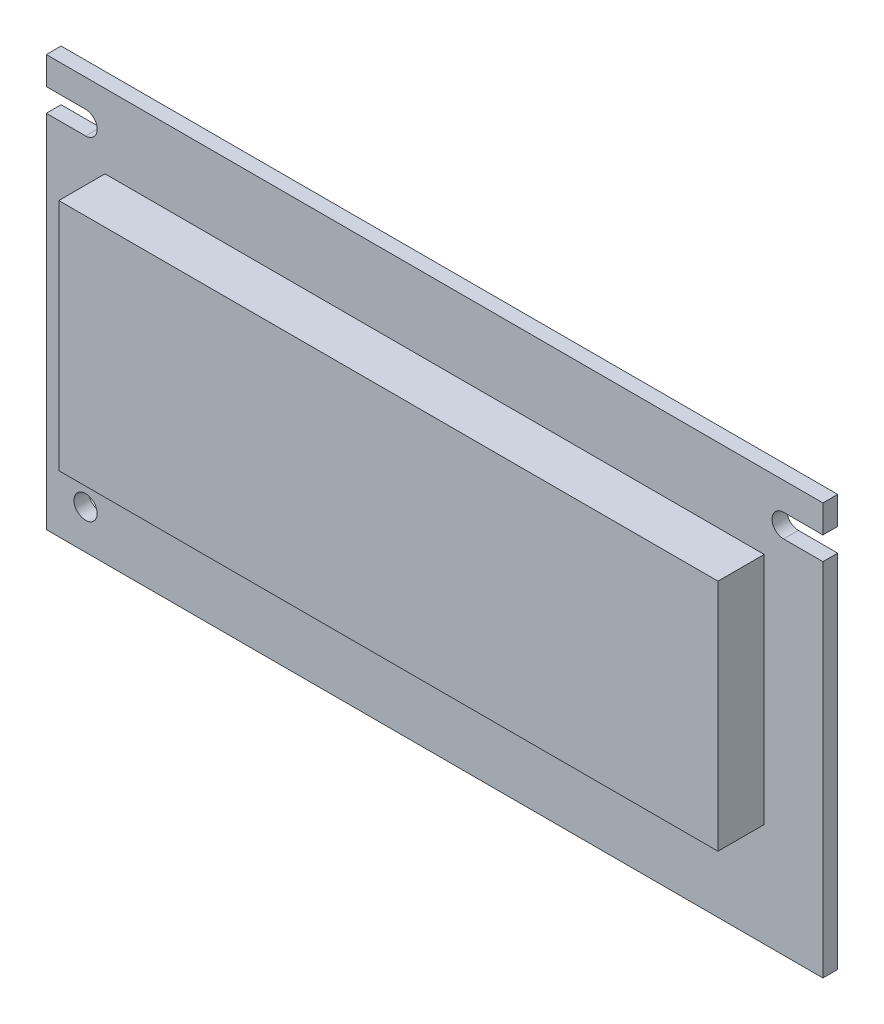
from build123d import *

# Parameters (mm, degrees)
ESQUISSE1_W             = 84
ESQUISSE1_H             = 44.5
BOSS_EXTRU_1_DEPTH      = 1.6
ESQUISSE2_W             = 71.3
ESQUISSE2_H             = 25.3
BOSS_EXTRU_2_DEPTH      = 5
ENL_V_MAT_EXTRU_1_REACH = 97.191
ESQUISSE3_R             = 1.25
ESQUISSE4_W             = 59
ESQUISSE4_H             = 20
BOSS_EXTRU_3_DEPTH      = 12.5
ESQUISSE5_W             = 2
ESQUISSE5_H             = 8
BOSS_EXTRU_4_DEPTH      = 6
ENL_V_MAT_EXTRU_2_REACH = 98.099


with BuildPart() as part:
    # Esquisse1 → Boss.-Extru.1 (new body)
    with BuildSketch(Plane.XY):
        with Locations((42, 22.25)):
            Rectangle(ESQUISSE1_W, ESQUISSE1_H)
    extrude(amount=BOSS_EXTRU_1_DEPTH)

    # Esquisse2 → Boss.-Extru.2 (add)
    with BuildSketch(Plane.XY.offset(1.6)):
        with Locations((42, 23.85)):
            Rectangle(ESQUISSE2_W, ESQUISSE2_H)
    extrude(amount=BOSS_EXTRU_2_DEPTH)

    # Esquisse3 → Enl_v. mat.-Extru.1 (cut, up to next)
    with BuildSketch(Plane.XY.offset(1.6), mode=Mode.PRIVATE) as enl_v_mat_extru_1_sk1:
        with Locations((79.75, 40.25)):
            Circle(ESQUISSE3_R)
    enl_v_mat_extru_1_tool1 = extrude(enl_v_mat_extru_1_sk1.sketch, amount=-ENL_V_MAT_EXTRU_1_REACH, mode=Mode.PRIVATE) & part.part
    # Esquisse3 → Enl_v. mat.-Extru.1 (cut, up to next)
    with BuildSketch(Plane.XY.offset(1.6), mode=Mode.PRIVATE) as enl_v_mat_extru_1_sk2:
        with Locations((4.25, 4.25)):
            Circle(ESQUISSE3_R)
    enl_v_mat_extru_1_tool2 = extrude(enl_v_mat_extru_1_sk2.sketch, amount=-ENL_V_MAT_EXTRU_1_REACH, mode=Mode.PRIVATE) & part.part
    # Esquisse3 → Enl_v. mat.-Extru.1 (cut, up to next)
    with BuildSketch(Plane.XY.offset(1.6), mode=Mode.PRIVATE) as enl_v_mat_extru_1_sk3:
        with Locations((4.25, 40.25)):
            Circle(ESQUISSE3_R)
    enl_v_mat_extru_1_tool3 = extrude(enl_v_mat_extru_1_sk3.sketch, amount=-ENL_V_MAT_EXTRU_1_REACH, mode=Mode.PRIVATE) & part.part
    add(enl_v_mat_extru_1_tool1.solids().sort_by_distance((79.75, 40.25, 1.6))[0], mode=Mode.SUBTRACT)
    add(enl_v_mat_extru_1_tool2.solids().sort_by_distance((4.25, 4.25, 1.6))[0], mode=Mode.SUBTRACT)
    add(enl_v_mat_extru_1_tool3.solids().sort_by_distance((4.25, 40.25, 1.6))[0], mode=Mode.SUBTRACT)

    # Esquisse4 → Boss.-Extru.3 (add)
    with BuildSketch(Plane(origin=(0, 0, 0), x_dir=(-1, 0, 0), z_dir=(0, 0, -1))):
        with Locations((-37.5, 10)):
            Rectangle(ESQUISSE4_W, ESQUISSE4_H)
    extrude(amount=BOSS_EXTRU_3_DEPTH)

    # Esquisse5 → Boss.-Extru.4 (add)
    with BuildSketch(Plane.ZY.offset(-8)):
        with Locations((-6.5, 11.536783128)):
            Rectangle(ESQUISSE5_W, ESQUISSE5_H)
    extrude(amount=BOSS_EXTRU_4_DEPTH)

    # Esquisse6 → Enl_v. mat.-Extru.2 (cut, up to next)
    with BuildSketch(Plane.XY.offset(1.6), mode=Mode.PRIVATE) as enl_v_mat_extru_2_sk1:
        with BuildLine():
            Line((79.75, 41.5), (84, 41.5))
            Line((84, 41.5), (84, 39))
            Line((84, 39), (79.75, 39))
            ThreePointArc((79.75, 39), (78.5, 40.25), (79.75, 41.5))
        make_face()
    enl_v_mat_extru_2_tool1 = extrude(enl_v_mat_extru_2_sk1.sketch, amount=-ENL_V_MAT_EXTRU_2_REACH, mode=Mode.PRIVATE) & part.part
    # Esquisse6 → Enl_v. mat.-Extru.2 (cut, up to next)
    with BuildSketch(Plane.XY.offset(1.6), mode=Mode.PRIVATE) as enl_v_mat_extru_2_sk2:
        with BuildLine():
            Line((4.25, 41.5), (0, 41.5))
            Line((0, 41.5), (0, 39))
            Line((0, 39), (4.25, 39))
            ThreePointArc((4.25, 39), (5.5, 40.25), (4.25, 41.5))
        make_face()
    enl_v_mat_extru_2_tool2 = extrude(enl_v_mat_extru_2_sk2.sketch, amount=-ENL_V_MAT_EXTRU_2_REACH, mode=Mode.PRIVATE) & part.part
    add(enl_v_mat_extru_2_tool1.solids().sort_by_distance((81.376687, 40.25, 1.6))[0], mode=Mode.SUBTRACT)
    add(enl_v_mat_extru_2_tool2.solids().sort_by_distance((2.623313, 40.25, 1.6))[0], mode=Mode.SUBTRACT)


solid = part.part
